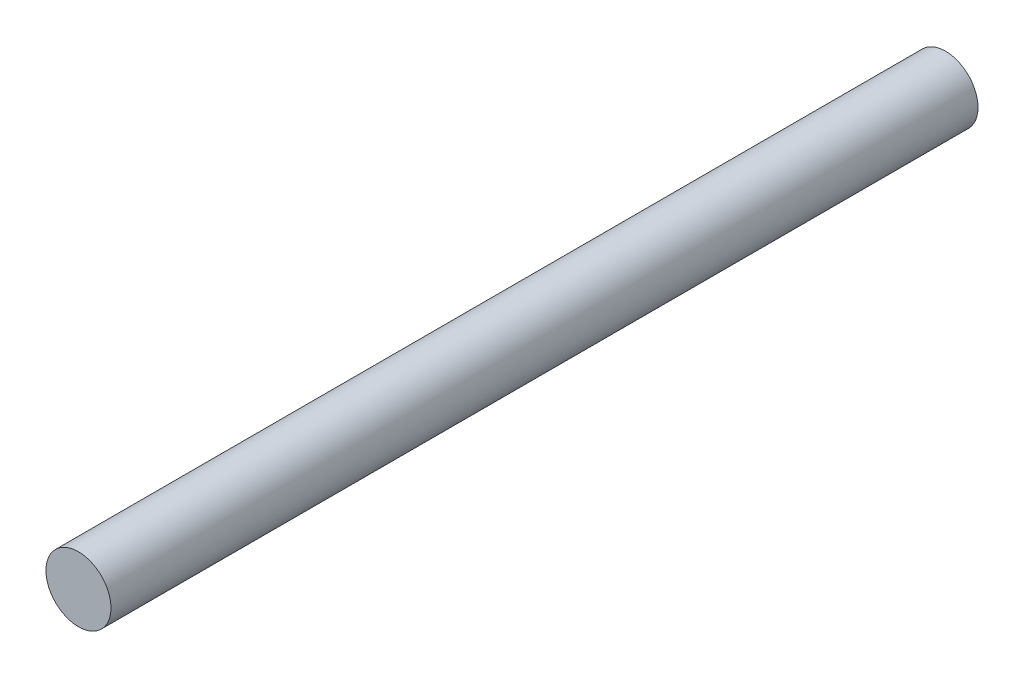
ISO-10303-21;
HEADER;
FILE_DESCRIPTION(('STEP AP214'),'2;1');
FILE_NAME('part.step','',(''),(''),'','','');
FILE_SCHEMA(('AUTOMOTIVE_DESIGN { 1 0 10303 214 1 1 1 1 }'));
ENDSEC;
DATA;
#1=APPLICATION_CONTEXT('core data for automotive mechanical design processes');
#2=APPLICATION_PROTOCOL_DEFINITION('international standard','automotive_design',2000,#1);
#3=PRODUCT_CONTEXT('',#1,'mechanical');
#4=PRODUCT('Part','Part','',(#3));
#5=PRODUCT_RELATED_PRODUCT_CATEGORY('part','',(#4));
#6=PRODUCT_DEFINITION_FORMATION('','',#4);
#7=PRODUCT_DEFINITION_CONTEXT('part definition',#1,'design');
#8=PRODUCT_DEFINITION('design','',#6,#7);
#9=PRODUCT_DEFINITION_SHAPE('','',#8);
#10=(LENGTH_UNIT() NAMED_UNIT(*) SI_UNIT(.MILLI.,.METRE.));
#11=(NAMED_UNIT(*) PLANE_ANGLE_UNIT() SI_UNIT($,.RADIAN.));
#12=(NAMED_UNIT(*) SI_UNIT($,.STERADIAN.) SOLID_ANGLE_UNIT());
#13=UNCERTAINTY_MEASURE_WITH_UNIT(LENGTH_MEASURE(1.E-05),#10,'distance_accuracy_value','');
#14=(GEOMETRIC_REPRESENTATION_CONTEXT(3) GLOBAL_UNCERTAINTY_ASSIGNED_CONTEXT((#13)) GLOBAL_UNIT_ASSIGNED_CONTEXT((#10,
#11,#12)) REPRESENTATION_CONTEXT('',''));
#15=CARTESIAN_POINT('',(0.,0.,0.));
#16=DIRECTION('',(0.,0.,1.));
#17=DIRECTION('',(1.,0.,0.));
#18=AXIS2_PLACEMENT_3D('',#15,#16,#17);
#19=CARTESIAN_POINT('',(0.,0.,-800.));
#20=DIRECTION('',(0.,0.,1.));
#21=DIRECTION('',(1.,0.,0.));
#22=AXIS2_PLACEMENT_3D('',#19,#20,#21);
#23=CYLINDRICAL_SURFACE('',#22,30.);
#24=CARTESIAN_POINT('',(0.,0.,-800.));
#25=DIRECTION('',(0.,0.,1.));
#26=DIRECTION('',(1.,0.,0.));
#27=AXIS2_PLACEMENT_3D('',#24,#25,#26);
#28=CIRCLE('',#27,30.);
#29=CARTESIAN_POINT('',(30.,0.,-800.));
#30=VERTEX_POINT('',#29);
#31=EDGE_CURVE('E10',#30,#30,#28,.T.);
#32=ORIENTED_EDGE('',*,*,#31,.T.);
#33=EDGE_LOOP('',(#32));
#34=FACE_BOUND('',#33,.T.);
#35=CARTESIAN_POINT('',(0.,0.,0.));
#36=DIRECTION('',(0.,0.,1.));
#37=DIRECTION('',(1.,0.,0.));
#38=AXIS2_PLACEMENT_3D('',#35,#36,#37);
#39=CIRCLE('',#38,30.);
#40=CARTESIAN_POINT('',(30.,0.,0.));
#41=VERTEX_POINT('',#40);
#42=EDGE_CURVE('E40',#41,#41,#39,.T.);
#43=ORIENTED_EDGE('',*,*,#42,.F.);
#44=EDGE_LOOP('',(#43));
#45=FACE_BOUND('',#44,.T.);
#46=ADVANCED_FACE('F37',(#34,#45),#23,.T.);
#47=CARTESIAN_POINT('',(0.,0.,-800.));
#48=DIRECTION('',(0.,0.,1.));
#49=DIRECTION('',(1.,0.,0.));
#50=AXIS2_PLACEMENT_3D('',#47,#48,#49);
#51=PLANE('',#50);
#52=ORIENTED_EDGE('',*,*,#31,.F.);
#53=EDGE_LOOP('',(#52));
#54=FACE_BOUND('',#53,.T.);
#55=ADVANCED_FACE('F54',(#54),#51,.F.);
#56=CARTESIAN_POINT('',(0.,0.,0.));
#57=DIRECTION('',(0.,0.,1.));
#58=DIRECTION('',(1.,0.,0.));
#59=AXIS2_PLACEMENT_3D('',#56,#57,#58);
#60=PLANE('',#59);
#61=ORIENTED_EDGE('',*,*,#42,.T.);
#62=EDGE_LOOP('',(#61));
#63=FACE_BOUND('',#62,.T.);
#64=ADVANCED_FACE('F51',(#63),#60,.T.);
#65=CLOSED_SHELL('',(#46,#55,#64));
#66=MANIFOLD_SOLID_BREP('B2',#65);
#67=ADVANCED_BREP_SHAPE_REPRESENTATION('',(#18,#66),#14);
#68=SHAPE_DEFINITION_REPRESENTATION(#9,#67);
ENDSEC;
END-ISO-10303-21;
